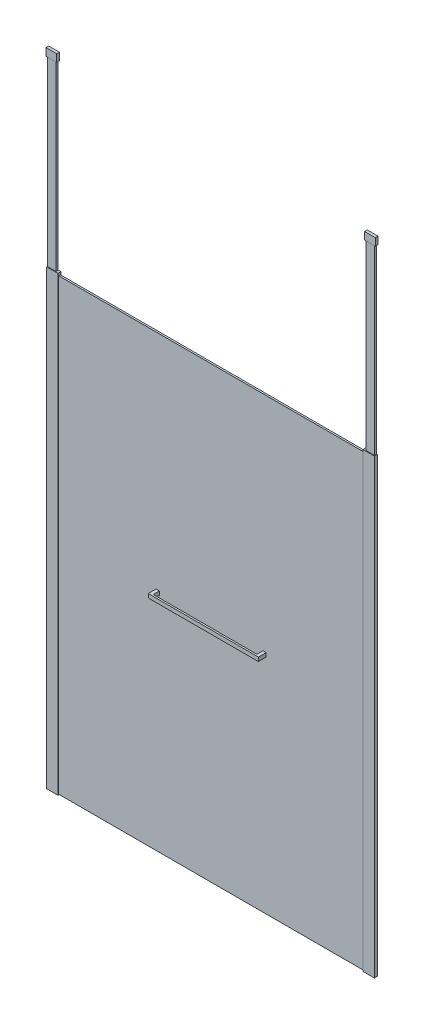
from build123d import *

# Parameters (mm, degrees)
DODANIE_WYCI_GNI_CIE1_START         = 3
DODANIE_WYCI_GNI_CIE1_DEPTH         = 2100
SZKIC2_W                            = 1447
SZKIC2_H                            = 8
DODANIE_WYCI_GNI_CIE2_DEPTH         = 2100
DODANIE_WYCI_GNI_CIE3_DEPTH         = 2108
SZKIC4_W                            = 53
SZKIC4_H                            = 14
DODANIE_WYCI_GNI_CIE4_DEPTH         = 11
SZKIC5_W                            = 53
SZKIC5_H                            = 14
DODANIE_WYCI_GNI_CIE5_DEPTH         = 3
SZKIC6_W                            = 8.1
SZKIC6_H                            = 7.8
DODANIE_WYCI_GNI_CIE6_DEPTH         = 15
SZKIC7_W                            = 53
SZKIC7_H                            = 14
DODANIE_WYCI_GNI_CIE7_DEPTH         = 3
SZKIC8_W                            = 53
SZKIC8_H                            = 14
DODANIE_WYCI_GNI_CIE8_DEPTH         = 3
SZKIC9_W                            = 40
SZKIC9_H                            = 8
DODANIE_WYCI_GNI_CIE9_DEPTH         = 883
DODANIE_WYCI_GNI_CIE9_2_DEPTH       = 883
DODANIE_WYCI_GNI_CIE10_START        = -32
SZKIC10_W                           = 50
SZKIC10_H                           = 12.5
DODANIE_WYCI_GNI_CIE10_DEPTH        = 35
DODANIE_WYCI_GNI_CIE11_DEPTH        = 36.5
DODANIE_WYCI_GNI_CIE11_DEPTH_BACK   = 18
SZKIC12_W                           = 15
SZKIC12_H                           = 18
DODANIE_WYCI_GNI_CIE11_2_DEPTH      = 36.5
DODANIE_WYCI_GNI_CIE11_2_DEPTH_BACK = 18
SZKIC13_W                           = 8
SZKIC13_H                           = 18
DODANIE_WYCI_GNI_CIE12_DEPTH        = 485


with BuildPart() as part:
    # Szkic1 → Dodanie-wyci_gni_cie1 (new body)
    with BuildSketch(Plane(origin=(0, 0, 0), x_dir=(1, 0, 0), z_dir=(0, 1, 0)).offset(DODANIE_WYCI_GNI_CIE1_START)):
        Polygon((0, 0), (0, 14), (53, 14), (53, 11), (42.9, 11), (42.9, 3), (53, 3), (53, 0), align=None)
    extrude(amount=DODANIE_WYCI_GNI_CIE1_DEPTH)

    # Szkic4 → Dodanie-wyci_gni_cie4 (add)
    with BuildSketch(Plane(origin=(0, 2103, 0), x_dir=(1, 0, 0), z_dir=(0, 1, 0))):
        with Locations((26.5, 7)):
            Rectangle(SZKIC4_W, SZKIC4_H)
    extrude(amount=DODANIE_WYCI_GNI_CIE4_DEPTH)

    # Szkic8 → Dodanie-wyci_gni_cie8 (add)
    with BuildSketch(Plane.XZ.offset(-3)):
        with Locations((26.5, -7)):
            Rectangle(SZKIC8_W, SZKIC8_H)
    extrude(amount=DODANIE_WYCI_GNI_CIE8_DEPTH)


with BuildPart() as body_2:
    # Szkic2 → Dodanie-wyci_gni_cie2 (new body)
    with BuildSketch(Plane.XZ.offset(-3)):
        with Locations((766.4, -7)):
            Rectangle(SZKIC2_W, SZKIC2_H)
    extrude(amount=-DODANIE_WYCI_GNI_CIE2_DEPTH)


with BuildPart() as body_3:
    # Szkic3 → Dodanie-wyci_gni_cie3 (new body)
    with BuildSketch(Plane.XZ.offset(-3)):
        Polygon((1479.8, -3), (1479.8, 0), (1532.8, 0), (1532.8, -14), (1479.8, -14), (1479.8, -11), (1489.9, -11), (1489.9, -3), align=None)
    extrude(amount=-DODANIE_WYCI_GNI_CIE3_DEPTH)

    # Szkic5 → Dodanie-wyci_gni_cie5 (add)
    with BuildSketch(Plane(origin=(0, 2111, 0), x_dir=(1, 0, 0), z_dir=(0, 1, 0))):
        with Locations((1506.3, 7)):
            Rectangle(SZKIC5_W, SZKIC5_H)
    extrude(amount=DODANIE_WYCI_GNI_CIE5_DEPTH)

    # Szkic6 → Dodanie-wyci_gni_cie6 (add)
    with BuildSketch(Plane.ZY.offset(-1479.8)):
        with Locations((-7, 2107.1)):
            Rectangle(SZKIC6_W, SZKIC6_H)
    extrude(amount=-DODANIE_WYCI_GNI_CIE6_DEPTH)

    # Szkic7 → Dodanie-wyci_gni_cie7 (add)
    with BuildSketch(Plane.XZ.offset(-3)):
        with Locations((1506.3, -7)):
            Rectangle(SZKIC7_W, SZKIC7_H)
    extrude(amount=DODANIE_WYCI_GNI_CIE7_DEPTH)


with BuildPart() as body_4:
    # Szkic9 → Dodanie-wyci_gni_cie9 (new body)
    with BuildSketch(Plane(origin=(0, 2114, 2099.6), x_dir=(-1, 0, 0), z_dir=(0, -1, 0))):
        with Locations((-1511.3, 2106.6)):
            Rectangle(SZKIC9_W, SZKIC9_H)
    extrude(amount=-DODANIE_WYCI_GNI_CIE9_DEPTH)

    # Szkic10 → Dodanie-wyci_gni_cie10 (add)
    with BuildSketch(Plane(origin=(0, 2997, 0), x_dir=(-1, 0, 0), z_dir=(0, 1, 0)).offset(DODANIE_WYCI_GNI_CIE10_START)):
        with Locations((-1511.3, -7)):
            Rectangle(SZKIC10_W, SZKIC10_H)
        with Locations((-21.5, -7)):
            Rectangle(SZKIC10_W, SZKIC10_H)
    extrude(amount=DODANIE_WYCI_GNI_CIE10_DEPTH)


with BuildPart() as body_5:
    # Szkic9 → Dodanie-wyci_gni_cie9 2 (new body)
    with BuildSketch(Plane(origin=(0, 2114, 2099.6), x_dir=(-1, 0, 0), z_dir=(0, -1, 0))):
        with Locations((-21.5, 2106.6)):
            Rectangle(SZKIC9_W, SZKIC9_H)
    extrude(amount=-DODANIE_WYCI_GNI_CIE9_2_DEPTH)


with BuildPart() as dodanie_wyci_gni_cie10_piece_1:
    # of the separate pieces the step leaves, piece 1, a body of its own (dodanie_wyci_gni_cie10_pieces)
    add(body_4.part.solids().sort_by_distance((1531.3, 2114, -11))[0])


with BuildPart() as dodanie_wyci_gni_cie10_piece_2:
    # of the separate pieces the step leaves, piece 2, a body of its own (dodanie_wyci_gni_cie10_pieces)
    add(body_4.part.solids().sort_by_distance((-3.5, 2965, -13.25))[0])


with BuildPart() as body_7:
    # Szkic12 → Dodanie-wyci_gni_cie11 (new, two sides: drawn at the far end of the back side and taken through both)
    with BuildSketch(Plane.XY.offset(-3).offset(-DODANIE_WYCI_GNI_CIE11_DEPTH_BACK)):
        with Locations((516.4, 1053)):
            Rectangle(SZKIC12_W, SZKIC12_H)
    extrude(amount=DODANIE_WYCI_GNI_CIE11_DEPTH + DODANIE_WYCI_GNI_CIE11_DEPTH_BACK)



with BuildPart() as body_8:
    # Szkic12 → Dodanie-wyci_gni_cie11 2 (new, two sides: drawn at the far end of the back side and taken through both)
    with BuildSketch(Plane.XY.offset(-3).offset(-DODANIE_WYCI_GNI_CIE11_2_DEPTH_BACK)):
        with Locations((1016.4, 1053)):
            Rectangle(SZKIC12_W, SZKIC12_H)
    extrude(amount=DODANIE_WYCI_GNI_CIE11_2_DEPTH + DODANIE_WYCI_GNI_CIE11_2_DEPTH_BACK)


with BuildPart() as body_7_1:
    add(body_7.part)

    add(body_8.part)  # Dodanie-wyci_gni_cie12 merges body 8
    # Szkic13 → Dodanie-wyci_gni_cie12 (add)
    with BuildSketch(Plane(origin=(523.9, 0, 0), x_dir=(0, 0, -1), z_dir=(1, 0, 0))):
        with Locations((-29.5, 1053)):
            Rectangle(SZKIC13_W, SZKIC13_H)
    extrude(amount=DODANIE_WYCI_GNI_CIE12_DEPTH)


solid = Compound([part.part, body_2.part, body_3.part, body_5.part, dodanie_wyci_gni_cie10_piece_1.part, dodanie_wyci_gni_cie10_piece_2.part, body_7_1.part])
